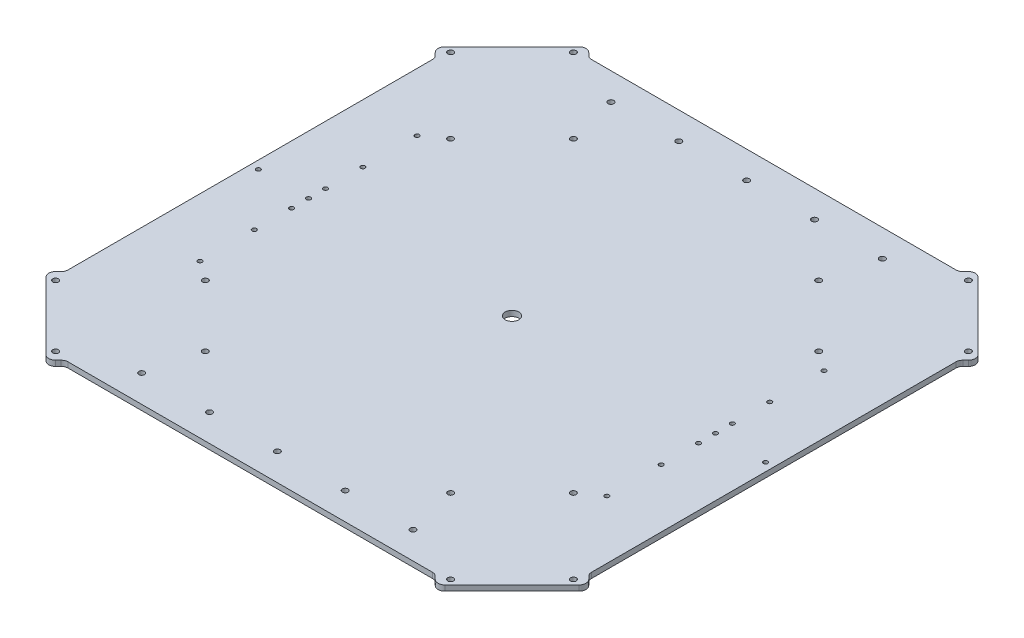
from build123d import *

# Parameters (mm, degrees)
EXTRUDE_1_DEPTH     = 4
SKETCH_2_R          = 2.1
CUT_EXTRUDE_1_DEPTH = 283.870995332
CUT_EXTRUDE_2_DEPTH = 283.870995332
SKETCH_4_R          = 5
CUT_EXTRUDE_3_DEPTH = 283.870995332
SKETCH_5_R          = 16
CUT_EXTRUDE_4_DEPTH = 283.870995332
SKETCH_6_R          = 1.6
CUT_EXTRUDE_5_DEPTH = 283.870995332
SKETCH_7_R          = 2.1
CUT_EXTRUDE_6_DEPTH = 283.870995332
EXTRUDE_START       = -4
SKETCH_8_R          = 18.343587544
SKETCH_8_R_2        = 16
SKETCH_8_R_3        = 18.735368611
SKETCH_8_R_4        = 18.876402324
EXTRUDE_2_DEPTH     = 4
SKETCH_9_R          = 1.6
CUT_EXTRUDE_7_DEPTH = 10
SKETCH_10_R         = 1.6
CUT_EXTRUDE_8_DEPTH = 10
FILLET_1_R          = 5


with BuildPart() as part:
    # Sketch 1 → Extrude 1 (new body)
    with BuildSketch(Plane(origin=(0, 0, 0), x_dir=(1, 0, 0), z_dir=(0, 1, 0))):
        Polygon((143.431457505, 200), (-143.431457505, 200), (-200, 143.431457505), (-200, -143.431457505), (-143.431457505, -200), (143.431457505, -200), (200, -143.431457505), (200, 143.431457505), align=None)
    extrude(amount=EXTRUDE_1_DEPTH)

    # Sketch 2 → Cut-Extrude 1 (cut, through all)
    with BuildSketch(Plane(origin=(0, 4, 0), x_dir=(1, 0, 0), z_dir=(0, 1, 0))):
        with Locations(Location((-190.807611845, 145.552777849, 0), (0, 0, 270))):
            Circle(SKETCH_2_R)
        with Locations(Location((-145.552777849, 190.807611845, 0), (0, 0, 270))):
            Circle(SKETCH_2_R)
        with Locations(Location((-135.653282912, 90.398448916, 0), (0, 0, 270))):
            Circle(SKETCH_2_R)
        with Locations(Location((-90.398448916, 135.653282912, 0), (0, 0, 270))):
            Circle(SKETCH_2_R)
        with Locations(Location((145.552777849, 190.807611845, 0), (0, 0, 270))):
            Circle(SKETCH_2_R)
        with Locations(Location((190.807611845, 145.552777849, 0), (0, 0, 270))):
            Circle(SKETCH_2_R)
        with Locations(Location((90.398448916, 135.653282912, 0), (0, 0, 270))):
            Circle(SKETCH_2_R)
        with Locations(Location((135.653282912, 90.398448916, 0), (0, 0, 270))):
            Circle(SKETCH_2_R)
        with Locations(Location((190.807611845, -145.552777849, 0), (0, 0, 270))):
            Circle(SKETCH_2_R)
        with Locations(Location((145.552777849, -190.807611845, 0), (0, 0, 270))):
            Circle(SKETCH_2_R)
        with Locations(Location((135.653282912, -90.398448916, 0), (0, 0, 270))):
            Circle(SKETCH_2_R)
        with Locations(Location((90.398448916, -135.653282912, 0), (0, 0, 270))):
            Circle(SKETCH_2_R)
        with Locations(Location((-145.552777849, -190.807611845, 0), (0, 0, 270))):
            Circle(SKETCH_2_R)
        with Locations(Location((-190.807611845, -145.552777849, 0), (0, 0, 270))):
            Circle(SKETCH_2_R)
        with Locations(Location((-90.398448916, -135.653282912, 0), (0, 0, 270))):
            Circle(SKETCH_2_R)
        with Locations(Location((-135.653282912, -90.398448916, 0), (0, 0, 270))):
            Circle(SKETCH_2_R)
    extrude(amount=-CUT_EXTRUDE_1_DEPTH, mode=Mode.SUBTRACT)

    # Sketch 3 → Cut-Extrude 2 (cut, through all)
    with BuildSketch(Plane(origin=(0, 4, 0), x_dir=(1, 0, 0), z_dir=(0, 1, 0))):
        Polygon((-200, 143.431457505), (-192.928932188, 136.360389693), (-192.928932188, -136.360389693), (-200, -143.431457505), align=None)
        Polygon((143.431457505, 200), (136.360389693, 192.928932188), (-136.360389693, 192.928932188), (-143.431457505, 200), align=None)
        Polygon((200, -143.431457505), (192.928932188, -136.360389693), (192.928932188, 136.360389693), (200, 143.431457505), align=None)
        Polygon((-143.431457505, -200), (-136.360389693, -192.928932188), (136.360389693, -192.928932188), (143.431457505, -200), align=None)
    extrude(amount=-CUT_EXTRUDE_2_DEPTH, mode=Mode.SUBTRACT)

    # Sketch 4 → Cut-Extrude 3 (cut, through all)
    with BuildSketch(Plane(origin=(0, 4, 0), x_dir=(1, 0, 0), z_dir=(0, 1, 0))):
        with Locations(Location((0, 0, 0), (0, 0, 270))):
            Circle(SKETCH_4_R)
    extrude(amount=-CUT_EXTRUDE_3_DEPTH, mode=Mode.SUBTRACT)

    # Sketch 5 → Cut-Extrude 4 (cut, through all)
    with BuildSketch(Plane.XZ):
        with Locations(Location((162.928932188, 100, 0), (0, 0, 270))):
            Circle(SKETCH_5_R)
        with Locations(Location((162.928932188, -100, 0), (0, 0, 270))):
            Circle(SKETCH_5_R)
        with Locations(Location((-162.928932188, -100, 0), (0, 0, 90))):
            Circle(SKETCH_5_R)
        with Locations(Location((-162.928932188, 100, 0), (0, 0, 90))):
            Circle(SKETCH_5_R)
    extrude(amount=-CUT_EXTRUDE_4_DEPTH, mode=Mode.SUBTRACT)

    # Sketch 6 → Cut-Extrude 5 (cut, through all)
    with BuildSketch(Plane.XZ):
        with Locations(Location((-149.928932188, 80, 0), (0, 0, 270))):
            Circle(SKETCH_6_R)
        with Locations(Location((-149.928932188, 40, 0), (0, 0, 270))):
            Circle(SKETCH_6_R)
        with Locations(Location((-149.928932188, 0, 0), (0, 0, 270))):
            Circle(SKETCH_6_R)
        with Locations(Location((-149.928932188, -40, 0), (0, 0, 270))):
            Circle(SKETCH_6_R)
        with Locations(Location((-149.928932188, -80, 0), (0, 0, 270))):
            Circle(SKETCH_6_R)
        with Locations(Location((149.928932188, -80, 0), (0, 0, 90))):
            Circle(SKETCH_6_R)
        with Locations(Location((149.928932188, -40, 0), (0, 0, 90))):
            Circle(SKETCH_6_R)
        with Locations(Location((149.928932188, 0, 0), (0, 0, 90))):
            Circle(SKETCH_6_R)
        with Locations(Location((149.928932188, 40, 0), (0, 0, 90))):
            Circle(SKETCH_6_R)
        with Locations(Location((149.928932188, 80, 0), (0, 0, 90))):
            Circle(SKETCH_6_R)
    extrude(amount=-CUT_EXTRUDE_5_DEPTH, mode=Mode.SUBTRACT)

    # Sketch 7 → Cut-Extrude 6 (cut, through all)
    with BuildSketch(Plane(origin=(0, 4, 0), x_dir=(1, 0, 0), z_dir=(0, 1, 0))):
        with Locations(Location((0, 172.928932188, 0), (0, 0, 270))):
            Circle(SKETCH_7_R)
        with Locations(Location((50, 172.928932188, 0), (0, 0, 270))):
            Circle(SKETCH_7_R)
        with Locations(Location((100, 172.928932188, 0), (0, 0, 270))):
            Circle(SKETCH_7_R)
        with Locations(Location((-100, 172.928932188, 0), (0, 0, 90))):
            Circle(SKETCH_7_R)
        with Locations(Location((-50, 172.928932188, 0), (0, 0, 90))):
            Circle(SKETCH_7_R)
        with Locations(Location((-50, -172.928932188, 0), (0, 0, 270))):
            Circle(SKETCH_7_R)
        with Locations(Location((-100, -172.928932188, 0), (0, 0, 270))):
            Circle(SKETCH_7_R)
        with Locations(Location((100, -172.928932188, 0), (0, 0, 90))):
            Circle(SKETCH_7_R)
        with Locations(Location((50, -172.928932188, 0), (0, 0, 90))):
            Circle(SKETCH_7_R)
        with Locations(Location((0, -172.928932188, 0), (0, 0, 90))):
            Circle(SKETCH_7_R)
    extrude(amount=-CUT_EXTRUDE_6_DEPTH, mode=Mode.SUBTRACT)

    # Sketch 8 → Extrude 2 (add)
    with BuildSketch(Plane(origin=(0, 4, 0), x_dir=(1, 0, 0), z_dir=(0, 1, 0)).offset(EXTRUDE_START)):
        with Locations((-161.809017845, 100)):
            Circle(SKETCH_8_R)
        with Locations((162.928932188, 100)):
            Circle(SKETCH_8_R_2)
        with Locations((162.928932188, -100)):
            Circle(SKETCH_8_R_3)
        with Locations((-161.809017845, -100)):
            Circle(SKETCH_8_R_4)
    extrude(amount=EXTRUDE_2_DEPTH)

    # Sketch 9 → Cut-Extrude 7 (cut)
    with BuildSketch(Plane(origin=(0, 4, 0), x_dir=(1, 0, 0), z_dir=(0, 1, 0))):
        with Locations(Location((-149.928932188, 12.5, 0), (0, 0, 270))):
            Circle(SKETCH_9_R)
        with Locations(Location((-149.928932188, -12.5, 0), (0, 0, 270))):
            Circle(SKETCH_9_R)
        with Locations(Location((149.928932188, 12.5, 0), (0, 0, 270))):
            Circle(SKETCH_9_R)
        with Locations(Location((149.928932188, -12.5, 0), (0, 0, 270))):
            Circle(SKETCH_9_R)
    extrude(amount=-CUT_EXTRUDE_7_DEPTH, mode=Mode.SUBTRACT)

    # Sketch 10 → Cut-Extrude 8 (cut)
    with BuildSketch(Plane(origin=(0, 4, 0), x_dir=(1, 0, 0), z_dir=(0, 1, 0))):
        with Locations(Location((-186.928932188, 0, 0), (0, 0, 270))):
            Circle(SKETCH_10_R)
        with Locations(Location((186.928932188, 0, 0), (0, 0, 270))):
            Circle(SKETCH_10_R)
    extrude(amount=-CUT_EXTRUDE_8_DEPTH, mode=Mode.SUBTRACT)

    # Fillet 1
    fillet_1_edges = [part.edges().sort_by_distance(p)[0] for p in [
        (-192.928932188, 2, -136.360389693),
        (-192.928932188, 2, 136.360389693),
        (136.360389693, 2, -192.928932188),
        (-136.360389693, 2, -192.928932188),
        (192.928932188, 2, 136.360389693),
        (192.928932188, 2, -136.360389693),
        (-136.360389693, 2, 192.928932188),
        (136.360389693, 2, 192.928932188),
        (-200, 2, -143.431457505),
        (-143.431457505, 2, -200),
        (143.431457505, 2, -200),
        (200, 2, -143.431457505),
        (200, 2, 143.431457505),
        (143.431457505, 2, 200),
        (-143.431457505, 2, 200),
        (-200, 2, 143.431457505),
    ]]
    fillet(fillet_1_edges, radius=FILLET_1_R)


solid = part.part
